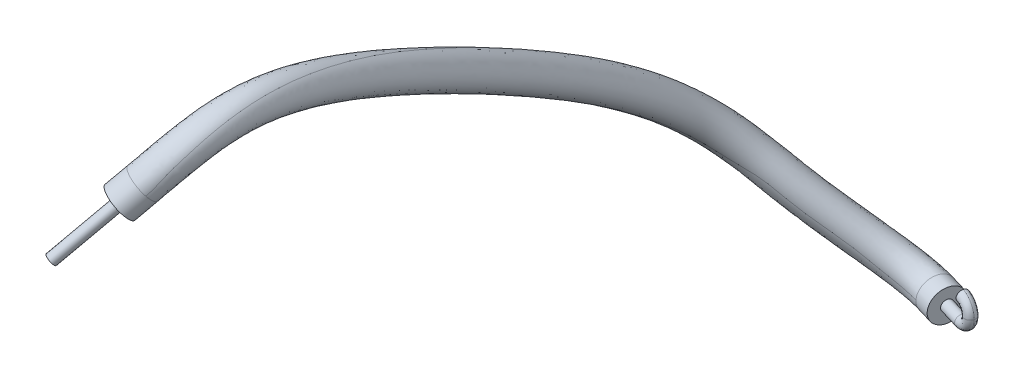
ISO-10303-21;
HEADER;
FILE_DESCRIPTION(('STEP AP214'),'2;1');
FILE_NAME('part.step','',(''),(''),'','','');
FILE_SCHEMA(('AUTOMOTIVE_DESIGN { 1 0 10303 214 1 1 1 1 }'));
ENDSEC;
DATA;
#1=APPLICATION_CONTEXT('core data for automotive mechanical design processes');
#2=APPLICATION_PROTOCOL_DEFINITION('international standard','automotive_design',2000,#1);
#3=PRODUCT_CONTEXT('',#1,'mechanical');
#4=PRODUCT('Part','Part','',(#3));
#5=PRODUCT_RELATED_PRODUCT_CATEGORY('part','',(#4));
#6=PRODUCT_DEFINITION_FORMATION('','',#4);
#7=PRODUCT_DEFINITION_CONTEXT('part definition',#1,'design');
#8=PRODUCT_DEFINITION('design','',#6,#7);
#9=PRODUCT_DEFINITION_SHAPE('','',#8);
#10=(LENGTH_UNIT() NAMED_UNIT(*) SI_UNIT(.MILLI.,.METRE.));
#11=(NAMED_UNIT(*) PLANE_ANGLE_UNIT() SI_UNIT($,.RADIAN.));
#12=(NAMED_UNIT(*) SI_UNIT($,.STERADIAN.) SOLID_ANGLE_UNIT());
#13=UNCERTAINTY_MEASURE_WITH_UNIT(LENGTH_MEASURE(1.E-05),#10,'distance_accuracy_value','');
#14=(GEOMETRIC_REPRESENTATION_CONTEXT(3) GLOBAL_UNCERTAINTY_ASSIGNED_CONTEXT((#13)) GLOBAL_UNIT_ASSIGNED_CONTEXT((#10,
#11,#12)) REPRESENTATION_CONTEXT('',''));
#15=CARTESIAN_POINT('',(0.,0.,0.));
#16=DIRECTION('',(0.,0.,1.));
#17=DIRECTION('',(1.,0.,0.));
#18=AXIS2_PLACEMENT_3D('',#15,#16,#17);
#19=CARTESIAN_POINT('',(-13.257789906,61.319217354,28.753534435));
#20=DIRECTION('',(-0.439842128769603,-0.67038088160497,0.597602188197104));
#21=DIRECTION('',(0.,-0.665425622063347,-0.746464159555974));
#22=AXIS2_PLACEMENT_3D('',#19,#20,#21);
#23=PLANE('',#22);
#24=CARTESIAN_POINT('',(-13.0305769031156,61.0677980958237,28.6387276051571));
#25=DIRECTION('',(0.439842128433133,0.67038088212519,-0.597602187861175));
#26=DIRECTION('',(0.,0.665425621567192,0.746464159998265));
#27=AXIS2_PLACEMENT_3D('',#24,#25,#26);
#28=CIRCLE('',#27,0.249999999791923);
#29=CARTESIAN_POINT('',(-13.0305769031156,61.2341545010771,28.8253436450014));
#30=VERTEX_POINT('',#29);
#31=EDGE_CURVE('E22',#30,#30,#28,.F.);
#32=ORIENTED_EDGE('',*,*,#31,.T.);
#33=EDGE_LOOP('',(#32));
#34=FACE_BOUND('',#33,.T.);
#35=ADVANCED_FACE('F17',(#34),#23,.T.);
#36=CARTESIAN_POINT('',(-13.0305769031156,61.0677980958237,28.6387276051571));
#37=DIRECTION('',(0.439842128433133,0.67038088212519,-0.597602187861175));
#38=DIRECTION('',(0.,0.665425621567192,0.746464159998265));
#39=AXIS2_PLACEMENT_3D('',#36,#37,#38);
#40=CYLINDRICAL_SURFACE('',#39,0.249999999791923);
#41=ORIENTED_EDGE('',*,*,#31,.F.);
#42=EDGE_LOOP('',(#41));
#43=FACE_BOUND('',#42,.T.);
#44=CARTESIAN_POINT('',(-11.7110505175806,63.0789407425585,26.8459210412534));
#45=DIRECTION('',(0.439842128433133,0.67038088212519,-0.597602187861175));
#46=DIRECTION('',(0.,0.665425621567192,0.746464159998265));
#47=AXIS2_PLACEMENT_3D('',#44,#45,#46);
#48=CIRCLE('',#47,0.249999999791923);
#49=CARTESIAN_POINT('',(-11.7110505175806,63.2452971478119,27.0325370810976));
#50=VERTEX_POINT('',#49);
#51=EDGE_CURVE('E81',#50,#50,#48,.F.);
#52=ORIENTED_EDGE('',*,*,#51,.T.);
#53=EDGE_LOOP('',(#52));
#54=FACE_BOUND('',#53,.T.);
#55=ADVANCED_FACE('F358',(#43,#54),#40,.T.);
#56=CARTESIAN_POINT('',(-12.632415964,63.625810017,26.781254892));
#57=DIRECTION('',(0.439842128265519,0.670380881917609,-0.597602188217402));
#58=DIRECTION('',(0.793692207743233,0.0212013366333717,0.607949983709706));
#59=AXIS2_PLACEMENT_3D('',#56,#57,#58);
#60=PLANE('',#59);
#61=ORIENTED_EDGE('',*,*,#51,.F.);
#62=EDGE_LOOP('',(#61));
#63=FACE_BOUND('',#62,.T.);
#64=CARTESIAN_POINT('',(-11.7110505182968,63.0789407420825,26.845921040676));
#65=DIRECTION('',(-0.439842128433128,-0.670380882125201,0.597602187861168));
#66=DIRECTION('',(0.,-0.665425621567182,-0.746464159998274));
#67=AXIS2_PLACEMENT_3D('',#64,#65,#66);
#68=CIRCLE('',#67,0.749999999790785);
#69=CARTESIAN_POINT('',(-11.7110505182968,62.5798715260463,26.2860729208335));
#70=VERTEX_POINT('',#69);
#71=EDGE_CURVE('E230',#70,#70,#68,.T.);
#72=ORIENTED_EDGE('',*,*,#71,.T.);
#73=EDGE_LOOP('',(#72));
#74=FACE_BOUND('',#73,.T.);
#75=ADVANCED_FACE('F349',(#63,#74),#60,.F.);
#76=CARTESIAN_POINT('',(-11.2712083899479,63.7493216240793,26.2483188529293));
#77=DIRECTION('',(-0.439842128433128,-0.670380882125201,0.597602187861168));
#78=DIRECTION('',(0.,-0.665425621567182,-0.746464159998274));
#79=AXIS2_PLACEMENT_3D('',#76,#77,#78);
#80=CYLINDRICAL_SURFACE('',#79,0.749999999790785);
#81=CARTESIAN_POINT('',(-11.2712083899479,63.7493216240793,26.2483188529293));
#82=DIRECTION('',(-0.439842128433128,-0.670380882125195,0.597602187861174));
#83=DIRECTION('',(-6.94097557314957E-11,-0.665425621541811,-0.746464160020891));
#84=AXIS2_PLACEMENT_3D('',#81,#82,#83);
#85=CIRCLE('',#84,0.749999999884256);
#86=CARTESIAN_POINT('',(-11.2712083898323,63.250252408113,25.6884707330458));
#87=VERTEX_POINT('',#86);
#88=CARTESIAN_POINT('',(-11.8664775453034,63.7334206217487,25.7923563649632));
#89=VERTEX_POINT('',#88);
#90=EDGE_CURVE('E70',#87,#89,#85,.F.);
#91=ORIENTED_EDGE('',*,*,#90,.F.);
#92=CARTESIAN_POINT('',(-11.2712083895,63.7493216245,26.248318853));
#93=DIRECTION('',(-0.439842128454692,-0.670380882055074,0.597602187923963));
#94=DIRECTION('',(0.,-0.66542562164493,-0.746464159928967));
#95=AXIS2_PLACEMENT_3D('',#92,#93,#94);
#96=CIRCLE('',#95,0.749999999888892);
#97=CARTESIAN_POINT('',(-10.6759392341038,63.7652226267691,26.7042813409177));
#98=VERTEX_POINT('',#97);
#99=EDGE_CURVE('E65',#87,#98,#96,.T.);
#100=ORIENTED_EDGE('',*,*,#99,.T.);
#101=CARTESIAN_POINT('',(-11.2712083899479,63.7493216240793,26.2483188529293));
#102=DIRECTION('',(-0.439842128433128,-0.670380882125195,0.597602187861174));
#103=DIRECTION('',(-6.94097557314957E-11,-0.665425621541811,-0.746464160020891));
#104=AXIS2_PLACEMENT_3D('',#101,#102,#103);
#105=CIRCLE('',#104,0.749999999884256);
#106=EDGE_CURVE('E75',#89,#98,#105,.F.);
#107=ORIENTED_EDGE('',*,*,#106,.F.);
#108=EDGE_LOOP('',(#91,#100,#107));
#109=FACE_BOUND('',#108,.T.);
#110=ORIENTED_EDGE('',*,*,#71,.F.);
#111=EDGE_LOOP('',(#110));
#112=FACE_BOUND('',#111,.T.);
#113=ADVANCED_FACE('F77',(#109,#112),#80,.T.);
#114=CARTESIAN_POINT('',(-1.886410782,50.644767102,-1.243295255));
#115=CARTESIAN_POINT('',(-2.052787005,50.656435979,-1.284777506));
#116=CARTESIAN_POINT('',(-2.586047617,50.727554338,-1.360258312));
#117=CARTESIAN_POINT('',(-3.188660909,50.929511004,-1.292439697));
#118=CARTESIAN_POINT('',(-3.797920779,51.197778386,-1.132885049));
#119=CARTESIAN_POINT('',(-4.368413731,51.517762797,-0.897196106));
#120=CARTESIAN_POINT('',(-5.486408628,52.148771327,-0.3162714));
#121=CARTESIAN_POINT('',(-6.24005489,52.980694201,0.268587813));
#122=CARTESIAN_POINT('',(-7.140296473,53.832477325,0.87689808));
#123=CARTESIAN_POINT('',(-7.715127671,54.334418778,1.244054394));
#124=CARTESIAN_POINT('',(-8.307239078,55.404053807,1.819371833));
#125=CARTESIAN_POINT('',(-9.003777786,56.364388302,2.67623781));
#126=CARTESIAN_POINT('',(-9.575551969,57.457507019,3.858334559));
#127=CARTESIAN_POINT('',(-9.974741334,58.500195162,5.270972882));
#128=CARTESIAN_POINT('',(-10.205702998,59.386124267,6.651079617));
#129=CARTESIAN_POINT('',(-10.41721003,60.574937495,8.633242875));
#130=CARTESIAN_POINT('',(-10.491566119,62.298252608,11.763581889));
#131=CARTESIAN_POINT('',(-10.358875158,63.677179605,14.637016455));
#132=CARTESIAN_POINT('',(-10.174687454,64.768211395,17.197628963));
#133=CARTESIAN_POINT('',(-9.934112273,65.576395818,19.490581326));
#134=CARTESIAN_POINT('',(-9.773707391,65.950283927,21.619665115));
#135=CARTESIAN_POINT('',(-9.744957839,65.930275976,23.033957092));
#136=CARTESIAN_POINT('',(-9.780948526,65.773829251,23.946886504));
#137=CARTESIAN_POINT('',(-9.885116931,65.473127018,24.776622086));
#138=CARTESIAN_POINT('',(-10.064573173,65.023037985,25.513180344));
#139=CARTESIAN_POINT('',(-10.325200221,64.480863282,26.158382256));
#140=CARTESIAN_POINT('',(-10.543997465,63.966320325,26.525015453));
#141=CARTESIAN_POINT('',(-10.675939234,63.765222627,26.704281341));
#142=CARTESIAN_POINT('',(-1.787593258,52.141305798,-1.218657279));
#143=CARTESIAN_POINT('',(-1.792222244,52.141630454,-1.219811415));
#144=CARTESIAN_POINT('',(-2.239485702,52.187859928,-1.320241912));
#145=CARTESIAN_POINT('',(-2.598512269,52.31575642,-1.286961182));
#146=CARTESIAN_POINT('',(-3.093628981,52.52086295,-1.210418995));
#147=CARTESIAN_POINT('',(-3.589289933,52.792506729,-1.059768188));
#148=CARTESIAN_POINT('',(-4.727907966,53.372271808,-0.790300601));
#149=CARTESIAN_POINT('',(-5.368343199,54.150383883,-0.062831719));
#150=CARTESIAN_POINT('',(-6.25809006,54.98437797,0.489185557));
#151=CARTESIAN_POINT('',(-6.862844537,55.488258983,0.752327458));
#152=CARTESIAN_POINT('',(-7.160328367,56.398908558,1.768675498));
#153=CARTESIAN_POINT('',(-7.802267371,57.250853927,2.561901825));
#154=CARTESIAN_POINT('',(-8.29617759,58.234965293,3.725704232));
#155=CARTESIAN_POINT('',(-8.66255523,59.205140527,5.091996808));
#156=CARTESIAN_POINT('',(-8.872877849,60.044085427,6.44615633));
#157=CARTESIAN_POINT('',(-9.047975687,61.152610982,8.420981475));
#158=CARTESIAN_POINT('',(-9.024624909,62.669749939,11.633033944));
#159=CARTESIAN_POINT('',(-8.847688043,63.732144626,14.629319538));
#160=CARTESIAN_POINT('',(-8.696370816,64.478439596,17.301561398));
#161=CARTESIAN_POINT('',(-8.575710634,64.904978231,19.694794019));
#162=CARTESIAN_POINT('',(-8.600354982,65.016692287,21.772673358));
#163=CARTESIAN_POINT('',(-8.698775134,64.850891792,23.054665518));
#164=CARTESIAN_POINT('',(-8.816999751,64.626056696,23.832979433));
#165=CARTESIAN_POINT('',(-8.988511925,64.297379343,24.500429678));
#166=CARTESIAN_POINT('',(-9.247970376,63.843802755,25.066102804));
#167=CARTESIAN_POINT('',(-9.536435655,63.35039275,25.547982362));
#168=CARTESIAN_POINT('',(-9.952805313,62.794079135,25.794081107));
#169=CARTESIAN_POINT('',(-10.045597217,62.652651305,25.920155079));
#170=CARTESIAN_POINT('',(-2.150476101,52.141305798,0.236786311));
#171=CARTESIAN_POINT('',(-2.155105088,52.141630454,0.235632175));
#172=CARTESIAN_POINT('',(-2.205011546,52.15727089,0.203404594));
#173=CARTESIAN_POINT('',(-2.370536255,52.221506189,0.192730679));
#174=CARTESIAN_POINT('',(-2.66264102,52.380890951,0.224274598));
#175=CARTESIAN_POINT('',(-3.032731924,52.631742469,0.326614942));
#176=CARTESIAN_POINT('',(-3.88735004,53.349432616,0.47371045));
#177=CARTESIAN_POINT('',(-4.65057509,53.985682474,1.239106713));
#178=CARTESIAN_POINT('',(-5.508741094,54.845562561,1.783158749));
#179=CARTESIAN_POINT('',(-6.039341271,55.423782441,2.024753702));
#180=CARTESIAN_POINT('',(-6.597682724,55.823205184,3.061477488));
#181=CARTESIAN_POINT('',(-7.150656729,56.527117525,3.705410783));
#182=CARTESIAN_POINT('',(-7.62734007,57.311903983,4.7120143));
#183=CARTESIAN_POINT('',(-7.988043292,58.171163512,5.947243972));
#184=CARTESIAN_POINT('',(-8.20944263,58.941767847,7.218607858));
#185=CARTESIAN_POINT('',(-8.438676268,59.967081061,9.114371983));
#186=CARTESIAN_POINT('',(-8.633888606,61.362028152,12.300111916));
#187=CARTESIAN_POINT('',(-8.794210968,62.358849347,15.260838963));
#188=CARTESIAN_POINT('',(-9.003569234,63.107831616,17.856699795));
#189=CARTESIAN_POINT('',(-9.275182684,63.613263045,20.125635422));
#190=CARTESIAN_POINT('',(-9.543488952,63.847219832,21.959174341));
#191=CARTESIAN_POINT('',(-9.774493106,63.799226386,22.958653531));
#192=CARTESIAN_POINT('',(-9.955124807,63.693207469,23.500282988));
#193=CARTESIAN_POINT('',(-10.157081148,63.531925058,23.922821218));
#194=CARTESIAN_POINT('',(-10.423309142,63.314398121,24.288083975));
#195=CARTESIAN_POINT('',(-10.707468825,63.018073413,24.645698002));
#196=CARTESIAN_POINT('',(-11.143343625,62.76227713,24.882156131));
#197=CARTESIAN_POINT('',(-11.236135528,62.6208493,25.008230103));
#198=CARTESIAN_POINT('',(-2.249293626,50.644767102,0.212148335));
#199=CARTESIAN_POINT('',(-2.33479623,50.650763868,0.190830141));
#200=CARTESIAN_POINT('',(-2.589106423,50.699597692,0.154030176));
#201=CARTESIAN_POINT('',(-2.950629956,50.834555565,0.189759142));
#202=CARTESIAN_POINT('',(-3.369619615,51.057994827,0.301138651));
#203=CARTESIAN_POINT('',(-3.811163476,51.356949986,0.489359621));
#204=CARTESIAN_POINT('',(-4.646653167,52.125988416,0.947539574));
#205=CARTESIAN_POINT('',(-5.5224211,52.816002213,1.570492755));
#206=CARTESIAN_POINT('',(-6.390895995,53.693658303,2.170884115));
#207=CARTESIAN_POINT('',(-6.891646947,54.269943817,2.516475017));
#208=CARTESIAN_POINT('',(-7.744587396,54.828350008,3.112175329));
#209=CARTESIAN_POINT('',(-8.35216876,55.640652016,3.819746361));
#210=CARTESIAN_POINT('',(-8.906714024,56.534445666,4.844644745));
#211=CARTESIAN_POINT('',(-9.300229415,57.466218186,6.126220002));
#212=CARTESIAN_POINT('',(-9.542267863,58.283806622,7.423531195));
#213=CARTESIAN_POINT('',(-9.807910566,59.38940758,9.326633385));
#214=CARTESIAN_POINT('',(-10.100829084,60.990531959,12.430658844));
#215=CARTESIAN_POINT('',(-10.305399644,62.303881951,15.268537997));
#216=CARTESIAN_POINT('',(-10.481884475,63.39760554,17.752765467));
#217=CARTESIAN_POINT('',(-10.633573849,64.284696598,19.921408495));
#218=CARTESIAN_POINT('',(-10.716871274,64.78076588,21.806206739));
#219=CARTESIAN_POINT('',(-10.820630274,64.878679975,22.937883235));
#220=CARTESIAN_POINT('',(-10.919248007,64.840714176,23.614427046));
#221=CARTESIAN_POINT('',(-11.053033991,64.708666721,24.198127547));
#222=CARTESIAN_POINT('',(-11.242346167,64.489923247,24.738468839));
#223=CARTESIAN_POINT('',(-11.48714864,64.162390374,25.243754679));
#224=CARTESIAN_POINT('',(-11.754110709,63.904683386,25.639686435));
#225=CARTESIAN_POINT('',(-11.866477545,63.733420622,25.792356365));
#226=(BOUNDED_SURFACE() B_SPLINE_SURFACE(3,3,((#114,#115,#116,#117,#118,#119,#120,#121,#122,
#123,#124,#125,#126,#127,#128,#129,#130,#131,#132,#133,#134,#135,#136,#137,#138,#139,#140,#141),
(#142,#143,#144,#145,#146,#147,#148,#149,#150,#151,#152,#153,#154,#155,#156,#157,#158,#159,#160,
#161,#162,#163,#164,#165,#166,#167,#168,#169),(#170,#171,#172,#173,#174,#175,#176,#177,#178,
#179,#180,#181,#182,#183,#184,#185,#186,#187,#188,#189,#190,#191,#192,#193,#194,#195,#196,#197),
(#198,#199,#200,#201,#202,#203,#204,#205,#206,#207,#208,#209,#210,#211,#212,#213,#214,#215,#216,
#217,#218,#219,#220,#221,#222,#223,#224,#225)),.UNSPECIFIED.,.F.,.F.,
.F.) B_SPLINE_SURFACE_WITH_KNOTS((4,4),(4,1,1,1,1,1,1,1,1,1,1,1,1,1,1,1,1,1,1,1,1,1,1,1,1,4),
(0.,0.5),(0.,0.0280000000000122,0.056000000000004,0.0840000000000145,0.112,0.14,
0.246124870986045,0.25,0.296875,0.343750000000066,0.390625,0.4375,0.484375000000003,
0.512894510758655,0.531250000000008,0.6015625,0.668311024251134,0.671875,0.742187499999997,
0.8125,0.84375,0.875,0.90625,0.9375,0.96875,1.),
.UNSPECIFIED.) GEOMETRIC_REPRESENTATION_ITEM() RATIONAL_B_SPLINE_SURFACE(((1.,1.,1.,1.,1.,1.,1.,
1.,1.,1.,1.,1.,1.,1.,1.,1.,1.,1.,1.,1.,1.,1.,1.,1.,1.,1.,1.,1.),(0.333333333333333,
0.333333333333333,0.333333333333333,0.333333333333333,0.333333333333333,0.333333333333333,
0.333333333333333,0.333333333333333,0.333333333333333,0.333333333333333,0.333333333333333,
0.333333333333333,0.333333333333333,0.333333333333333,0.333333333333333,0.333333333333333,
0.333333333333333,0.333333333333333,0.333333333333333,0.333333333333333,0.333333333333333,
0.333333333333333,0.333333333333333,0.333333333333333,0.333333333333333,0.333333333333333,
0.333333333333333,0.333333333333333),(0.333333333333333,0.333333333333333,0.333333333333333,
0.333333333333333,0.333333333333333,0.333333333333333,0.333333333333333,0.333333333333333,
0.333333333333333,0.333333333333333,0.333333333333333,0.333333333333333,0.333333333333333,
0.333333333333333,0.333333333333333,0.333333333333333,0.333333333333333,0.333333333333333,
0.333333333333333,0.333333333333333,0.333333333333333,0.333333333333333,0.333333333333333,
0.333333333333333,0.333333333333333,0.333333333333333,0.333333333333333,0.333333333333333),(1.,
1.,1.,1.,1.,1.,1.,1.,1.,1.,1.,1.,1.,1.,1.,1.,1.,1.,1.,1.,1.,1.,1.,1.,1.,1.,1.,1.))) REPRESENTATION_ITEM('') SURFACE());
#227=CARTESIAN_POINT('',(-2.06785220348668,50.6447671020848,-0.515573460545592));
#228=DIRECTION('',(-0.968056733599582,0.0678951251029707,-0.241363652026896));
#229=DIRECTION('',(0.250673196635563,0.241363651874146,-0.937500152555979));
#230=AXIS2_PLACEMENT_3D('',#227,#228,#229);
#231=CIRCLE('',#230,0.750000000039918);
#232=CARTESIAN_POINT('',(-2.24929362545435,50.6447671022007,0.212148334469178));
#233=VERTEX_POINT('',#232);
#234=CARTESIAN_POINT('',(-1.88641078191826,50.6447671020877,-1.24329525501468));
#235=VERTEX_POINT('',#234);
#236=EDGE_CURVE('E206',#233,#235,#231,.T.);
#237=CARTESIAN_POINT('',(-1.886410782,50.644767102,-1.243295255));
#238=CARTESIAN_POINT('',(-2.052787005,50.656435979,-1.284777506));
#239=CARTESIAN_POINT('',(-2.586047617,50.727554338,-1.360258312));
#240=CARTESIAN_POINT('',(-3.188660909,50.929511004,-1.292439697));
#241=CARTESIAN_POINT('',(-3.797920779,51.197778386,-1.132885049));
#242=CARTESIAN_POINT('',(-4.368413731,51.517762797,-0.897196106));
#243=CARTESIAN_POINT('',(-5.486408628,52.148771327,-0.3162714));
#244=CARTESIAN_POINT('',(-6.24005489,52.980694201,0.268587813));
#245=CARTESIAN_POINT('',(-7.140296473,53.832477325,0.87689808));
#246=CARTESIAN_POINT('',(-7.715127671,54.334418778,1.244054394));
#247=CARTESIAN_POINT('',(-8.307239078,55.404053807,1.819371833));
#248=CARTESIAN_POINT('',(-9.003777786,56.364388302,2.67623781));
#249=CARTESIAN_POINT('',(-9.575551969,57.457507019,3.858334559));
#250=CARTESIAN_POINT('',(-9.974741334,58.500195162,5.270972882));
#251=CARTESIAN_POINT('',(-10.205702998,59.386124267,6.651079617));
#252=CARTESIAN_POINT('',(-10.41721003,60.574937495,8.633242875));
#253=CARTESIAN_POINT('',(-10.491566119,62.298252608,11.763581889));
#254=CARTESIAN_POINT('',(-10.358875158,63.677179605,14.637016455));
#255=CARTESIAN_POINT('',(-10.174687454,64.768211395,17.197628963));
#256=CARTESIAN_POINT('',(-9.934112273,65.576395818,19.490581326));
#257=CARTESIAN_POINT('',(-9.773707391,65.950283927,21.619665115));
#258=CARTESIAN_POINT('',(-9.744957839,65.930275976,23.033957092));
#259=CARTESIAN_POINT('',(-9.780948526,65.773829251,23.946886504));
#260=CARTESIAN_POINT('',(-9.885116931,65.473127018,24.776622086));
#261=CARTESIAN_POINT('',(-10.064573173,65.023037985,25.513180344));
#262=CARTESIAN_POINT('',(-10.325200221,64.480863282,26.158382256));
#263=CARTESIAN_POINT('',(-10.543997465,63.966320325,26.525015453));
#264=CARTESIAN_POINT('',(-10.675939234,63.765222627,26.704281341));
#265=B_SPLINE_CURVE_WITH_KNOTS('',3,(#237,#238,#239,#240,#241,#242,#243,#244,#245,#246,#247,
#248,#249,#250,#251,#252,#253,#254,#255,#256,#257,#258,#259,#260,#261,#262,#263,#264),
.UNSPECIFIED.,.F.,.F.,(4,1,1,1,1,1,1,1,1,1,1,1,1,1,1,1,1,1,1,1,1,1,1,1,1,4),(0.,
0.0280000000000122,0.056000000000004,0.0840000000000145,0.112,0.14,0.246124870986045,0.25,
0.296875,0.343750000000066,0.390625,0.4375,0.484375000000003,0.512894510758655,
0.531250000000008,0.6015625,0.668311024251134,0.671875,0.742187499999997,0.8125,0.84375,0.875,
0.90625,0.9375,0.96875,1.),.UNSPECIFIED.);
#266=EDGE_CURVE('E73',#235,#98,#265,.T.);
#267=CARTESIAN_POINT('',(-2.249293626,50.644767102,0.212148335));
#268=CARTESIAN_POINT('',(-2.33479623,50.650763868,0.190830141));
#269=CARTESIAN_POINT('',(-2.589106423,50.699597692,0.154030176));
#270=CARTESIAN_POINT('',(-2.950629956,50.834555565,0.189759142));
#271=CARTESIAN_POINT('',(-3.369619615,51.057994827,0.301138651));
#272=CARTESIAN_POINT('',(-3.811163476,51.356949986,0.489359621));
#273=CARTESIAN_POINT('',(-4.646653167,52.125988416,0.947539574));
#274=CARTESIAN_POINT('',(-5.5224211,52.816002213,1.570492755));
#275=CARTESIAN_POINT('',(-6.390895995,53.693658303,2.170884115));
#276=CARTESIAN_POINT('',(-6.891646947,54.269943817,2.516475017));
#277=CARTESIAN_POINT('',(-7.744587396,54.828350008,3.112175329));
#278=CARTESIAN_POINT('',(-8.35216876,55.640652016,3.819746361));
#279=CARTESIAN_POINT('',(-8.906714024,56.534445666,4.844644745));
#280=CARTESIAN_POINT('',(-9.300229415,57.466218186,6.126220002));
#281=CARTESIAN_POINT('',(-9.542267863,58.283806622,7.423531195));
#282=CARTESIAN_POINT('',(-9.807910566,59.38940758,9.326633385));
#283=CARTESIAN_POINT('',(-10.100829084,60.990531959,12.430658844));
#284=CARTESIAN_POINT('',(-10.305399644,62.303881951,15.268537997));
#285=CARTESIAN_POINT('',(-10.481884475,63.39760554,17.752765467));
#286=CARTESIAN_POINT('',(-10.633573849,64.284696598,19.921408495));
#287=CARTESIAN_POINT('',(-10.716871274,64.78076588,21.806206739));
#288=CARTESIAN_POINT('',(-10.820630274,64.878679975,22.937883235));
#289=CARTESIAN_POINT('',(-10.919248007,64.840714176,23.614427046));
#290=CARTESIAN_POINT('',(-11.053033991,64.708666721,24.198127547));
#291=CARTESIAN_POINT('',(-11.242346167,64.489923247,24.738468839));
#292=CARTESIAN_POINT('',(-11.48714864,64.162390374,25.243754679));
#293=CARTESIAN_POINT('',(-11.754110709,63.904683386,25.639686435));
#294=CARTESIAN_POINT('',(-11.866477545,63.733420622,25.792356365));
#295=B_SPLINE_CURVE_WITH_KNOTS('',3,(#267,#268,#269,#270,#271,#272,#273,#274,#275,#276,#277,
#278,#279,#280,#281,#282,#283,#284,#285,#286,#287,#288,#289,#290,#291,#292,#293,#294),
.UNSPECIFIED.,.F.,.F.,(4,1,1,1,1,1,1,1,1,1,1,1,1,1,1,1,1,1,1,1,1,1,1,1,1,4),(0.,
0.0280000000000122,0.056000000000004,0.0840000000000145,0.112,0.14,0.246124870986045,0.25,
0.296875,0.343750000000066,0.390625,0.4375,0.484375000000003,0.512894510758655,
0.531250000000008,0.6015625,0.668311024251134,0.671875,0.742187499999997,0.8125,0.84375,0.875,
0.90625,0.9375,0.96875,1.),.UNSPECIFIED.);
#296=EDGE_CURVE('E210',#89,#233,#295,.F.);
#297=ORIENTED_EDGE('',*,*,#236,.T.);
#298=ORIENTED_EDGE('',*,*,#266,.T.);
#299=ORIENTED_EDGE('',*,*,#99,.F.);
#300=ORIENTED_EDGE('',*,*,#90,.T.);
#301=ORIENTED_EDGE('',*,*,#296,.T.);
#302=EDGE_LOOP('',(#297,#298,#299,#300,#301));
#303=FACE_BOUND('',#302,.T.);
#304=ADVANCED_FACE('F68',(#303),#226,.F.);
#305=CARTESIAN_POINT('',(-2.249293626,50.644767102,0.212148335));
#306=CARTESIAN_POINT('',(-2.33479623,50.650763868,0.190830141));
#307=CARTESIAN_POINT('',(-2.589106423,50.699597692,0.154030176));
#308=CARTESIAN_POINT('',(-2.950629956,50.834555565,0.189759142));
#309=CARTESIAN_POINT('',(-3.369619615,51.057994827,0.301138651));
#310=CARTESIAN_POINT('',(-3.811163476,51.356949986,0.489359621));
#311=CARTESIAN_POINT('',(-4.646653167,52.125988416,0.947539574));
#312=CARTESIAN_POINT('',(-5.5224211,52.816002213,1.570492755));
#313=CARTESIAN_POINT('',(-6.390895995,53.693658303,2.170884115));
#314=CARTESIAN_POINT('',(-6.891646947,54.269943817,2.516475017));
#315=CARTESIAN_POINT('',(-7.744587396,54.828350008,3.112175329));
#316=CARTESIAN_POINT('',(-8.35216876,55.640652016,3.819746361));
#317=CARTESIAN_POINT('',(-8.906714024,56.534445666,4.844644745));
#318=CARTESIAN_POINT('',(-9.300229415,57.466218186,6.126220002));
#319=CARTESIAN_POINT('',(-9.542267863,58.283806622,7.423531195));
#320=CARTESIAN_POINT('',(-9.807910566,59.38940758,9.326633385));
#321=CARTESIAN_POINT('',(-10.100829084,60.990531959,12.430658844));
#322=CARTESIAN_POINT('',(-10.305399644,62.303881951,15.268537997));
#323=CARTESIAN_POINT('',(-10.481884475,63.39760554,17.752765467));
#324=CARTESIAN_POINT('',(-10.633573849,64.284696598,19.921408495));
#325=CARTESIAN_POINT('',(-10.716871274,64.78076588,21.806206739));
#326=CARTESIAN_POINT('',(-10.820630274,64.878679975,22.937883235));
#327=CARTESIAN_POINT('',(-10.919248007,64.840714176,23.614427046));
#328=CARTESIAN_POINT('',(-11.053033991,64.708666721,24.198127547));
#329=CARTESIAN_POINT('',(-11.242346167,64.489923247,24.738468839));
#330=CARTESIAN_POINT('',(-11.48714864,64.162390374,25.243754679));
#331=CARTESIAN_POINT('',(-11.754110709,63.904683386,25.639686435));
#332=CARTESIAN_POINT('',(-11.866477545,63.733420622,25.792356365));
#333=CARTESIAN_POINT('',(-2.34811115,49.148228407,0.187510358));
#334=CARTESIAN_POINT('',(-2.514487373,49.159897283,0.146028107));
#335=CARTESIAN_POINT('',(-2.973201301,49.241924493,0.104655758));
#336=CARTESIAN_POINT('',(-3.530723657,49.44760494,0.186787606));
#337=CARTESIAN_POINT('',(-4.076598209,49.735098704,0.378002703));
#338=CARTESIAN_POINT('',(-4.589595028,50.082157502,0.6521043));
#339=CARTESIAN_POINT('',(-5.405956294,50.902544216,1.421368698));
#340=CARTESIAN_POINT('',(-6.39426711,51.646321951,1.901878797));
#341=CARTESIAN_POINT('',(-7.273050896,52.541754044,2.558609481));
#342=CARTESIAN_POINT('',(-7.743952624,53.116105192,3.008196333));
#343=CARTESIAN_POINT('',(-8.891492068,53.833494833,3.162873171));
#344=CARTESIAN_POINT('',(-9.553680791,54.754186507,3.934081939));
#345=CARTESIAN_POINT('',(-10.186087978,55.75698735,4.977275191));
#346=CARTESIAN_POINT('',(-10.612415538,56.761272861,6.305196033));
#347=CARTESIAN_POINT('',(-10.875093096,57.625845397,7.628454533));
#348=CARTESIAN_POINT('',(-11.177144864,58.811734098,9.538894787));
#349=CARTESIAN_POINT('',(-11.567769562,60.619035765,12.561205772));
#350=CARTESIAN_POINT('',(-11.81658832,62.248914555,15.276237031));
#351=CARTESIAN_POINT('',(-11.960199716,63.687379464,17.648831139));
#352=CARTESIAN_POINT('',(-11.991965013,64.956130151,19.717181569));
#353=CARTESIAN_POINT('',(-11.890253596,65.714311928,21.653239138));
#354=CARTESIAN_POINT('',(-11.866767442,65.958133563,22.917112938));
#355=CARTESIAN_POINT('',(-11.883371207,65.988220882,23.728571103));
#356=CARTESIAN_POINT('',(-11.948986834,65.885408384,24.473433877));
#357=CARTESIAN_POINT('',(-12.061383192,65.665448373,25.188853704));
#358=CARTESIAN_POINT('',(-12.266828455,65.306707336,25.841811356));
#359=CARTESIAN_POINT('',(-12.364877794,65.047089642,26.397216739));
#360=CARTESIAN_POINT('',(-12.496819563,64.845991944,26.576482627));
#361=CARTESIAN_POINT('',(-1.985228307,49.148228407,-1.267933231));
#362=CARTESIAN_POINT('',(-2.313351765,49.171241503,-1.349743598));
#363=CARTESIAN_POINT('',(-2.932609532,49.267248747,-1.400274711));
#364=CARTESIAN_POINT('',(-3.77880955,49.543265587,-1.297918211));
#365=CARTESIAN_POINT('',(-4.502212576,49.874693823,-1.055351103));
#366=CARTESIAN_POINT('',(-5.14753753,50.243018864,-0.734624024));
#367=CARTESIAN_POINT('',(-6.244909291,50.925270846,0.1577578));
#368=CARTESIAN_POINT('',(-7.111766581,51.811004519,0.600007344));
#369=CARTESIAN_POINT('',(-8.022502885,52.680576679,1.264610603));
#370=CARTESIAN_POINT('',(-8.567410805,53.180578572,1.73578133));
#371=CARTESIAN_POINT('',(-9.45414979,54.409199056,1.870068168));
#372=CARTESIAN_POINT('',(-10.205288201,55.477922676,2.790573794));
#373=CARTESIAN_POINT('',(-10.854926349,56.680048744,3.990964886));
#374=CARTESIAN_POINT('',(-11.286927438,57.795249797,5.449948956));
#375=CARTESIAN_POINT('',(-11.538528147,58.728163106,6.856002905));
#376=CARTESIAN_POINT('',(-11.786444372,59.997264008,8.84550427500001));
#377=CARTESIAN_POINT('',(-11.958507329,61.926755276,11.894129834));
#378=CARTESIAN_POINT('',(-11.870062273,63.622214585,14.644713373));
#379=CARTESIAN_POINT('',(-11.653004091,65.057983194,17.093696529));
#380=CARTESIAN_POINT('',(-11.292513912,66.247813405,19.286368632));
#381=CARTESIAN_POINT('',(-10.9470598,66.883875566,21.466656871));
#382=CARTESIAN_POINT('',(-10.791140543,67.00966016,23.013248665));
#383=CARTESIAN_POINT('',(-10.744897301,66.921601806,24.060793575));
#384=CARTESIAN_POINT('',(-10.781721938,66.648874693,25.052814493));
#385=CARTESIAN_POINT('',(-10.881175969,66.202273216,25.960257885));
#386=CARTESIAN_POINT('',(-11.113964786,65.611333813,26.768782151));
#387=CARTESIAN_POINT('',(-11.135189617,65.138561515,27.255949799));
#388=CARTESIAN_POINT('',(-11.306281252,64.877793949,27.488407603));
#389=CARTESIAN_POINT('',(-1.886410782,50.644767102,-1.243295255));
#390=CARTESIAN_POINT('',(-2.052787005,50.656435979,-1.284777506));
#391=CARTESIAN_POINT('',(-2.586047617,50.727554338,-1.360258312));
#392=CARTESIAN_POINT('',(-3.188660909,50.929511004,-1.292439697));
#393=CARTESIAN_POINT('',(-3.797920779,51.197778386,-1.132885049));
#394=CARTESIAN_POINT('',(-4.368413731,51.517762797,-0.897196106));
#395=CARTESIAN_POINT('',(-5.486408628,52.148771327,-0.3162714));
#396=CARTESIAN_POINT('',(-6.24005489,52.980694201,0.268587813));
#397=CARTESIAN_POINT('',(-7.140296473,53.832477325,0.87689808));
#398=CARTESIAN_POINT('',(-7.715127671,54.334418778,1.244054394));
#399=CARTESIAN_POINT('',(-8.307239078,55.404053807,1.819371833));
#400=CARTESIAN_POINT('',(-9.003777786,56.364388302,2.67623781));
#401=CARTESIAN_POINT('',(-9.575551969,57.457507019,3.858334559));
#402=CARTESIAN_POINT('',(-9.974741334,58.500195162,5.270972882));
#403=CARTESIAN_POINT('',(-10.205702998,59.386124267,6.651079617));
#404=CARTESIAN_POINT('',(-10.41721003,60.574937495,8.633242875));
#405=CARTESIAN_POINT('',(-10.491566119,62.298252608,11.763581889));
#406=CARTESIAN_POINT('',(-10.358875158,63.677179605,14.637016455));
#407=CARTESIAN_POINT('',(-10.174687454,64.768211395,17.197628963));
#408=CARTESIAN_POINT('',(-9.934112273,65.576395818,19.490581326));
#409=CARTESIAN_POINT('',(-9.773707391,65.950283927,21.619665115));
#410=CARTESIAN_POINT('',(-9.744957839,65.930275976,23.033957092));
#411=CARTESIAN_POINT('',(-9.780948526,65.773829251,23.946886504));
#412=CARTESIAN_POINT('',(-9.885116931,65.473127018,24.776622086));
#413=CARTESIAN_POINT('',(-10.064573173,65.023037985,25.513180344));
#414=CARTESIAN_POINT('',(-10.325200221,64.480863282,26.158382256));
#415=CARTESIAN_POINT('',(-10.543997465,63.966320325,26.525015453));
#416=CARTESIAN_POINT('',(-10.675939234,63.765222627,26.704281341));
#417=(BOUNDED_SURFACE() B_SPLINE_SURFACE(3,3,((#305,#306,#307,#308,#309,#310,#311,#312,#313,
#314,#315,#316,#317,#318,#319,#320,#321,#322,#323,#324,#325,#326,#327,#328,#329,#330,#331,#332),
(#333,#334,#335,#336,#337,#338,#339,#340,#341,#342,#343,#344,#345,#346,#347,#348,#349,#350,#351,
#352,#353,#354,#355,#356,#357,#358,#359,#360),(#361,#362,#363,#364,#365,#366,#367,#368,#369,
#370,#371,#372,#373,#374,#375,#376,#377,#378,#379,#380,#381,#382,#383,#384,#385,#386,#387,#388),
(#389,#390,#391,#392,#393,#394,#395,#396,#397,#398,#399,#400,#401,#402,#403,#404,#405,#406,#407,
#408,#409,#410,#411,#412,#413,#414,#415,#416)),.UNSPECIFIED.,.F.,.F.,
.F.) B_SPLINE_SURFACE_WITH_KNOTS((4,4),(4,1,1,1,1,1,1,1,1,1,1,1,1,1,1,1,1,1,1,1,1,1,1,1,1,4),
(0.5,1.),(0.,0.0280000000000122,0.056000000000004,0.0840000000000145,0.112,0.14,
0.246124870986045,0.25,0.296875,0.343750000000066,0.390625,0.4375,0.484375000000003,
0.512894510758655,0.531250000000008,0.6015625,0.668311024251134,0.671875,0.742187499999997,
0.8125,0.84375,0.875,0.90625,0.9375,0.96875,1.),
.UNSPECIFIED.) GEOMETRIC_REPRESENTATION_ITEM() RATIONAL_B_SPLINE_SURFACE(((1.,1.,1.,1.,1.,1.,1.,
1.,1.,1.,1.,1.,1.,1.,1.,1.,1.,1.,1.,1.,1.,1.,1.,1.,1.,1.,1.,1.),(0.333333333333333,
0.333333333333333,0.333333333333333,0.333333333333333,0.333333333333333,0.333333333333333,
0.333333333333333,0.333333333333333,0.333333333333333,0.333333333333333,0.333333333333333,
0.333333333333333,0.333333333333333,0.333333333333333,0.333333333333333,0.333333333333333,
0.333333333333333,0.333333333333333,0.333333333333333,0.333333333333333,0.333333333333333,
0.333333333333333,0.333333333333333,0.333333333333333,0.333333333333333,0.333333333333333,
0.333333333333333,0.333333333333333),(0.333333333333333,0.333333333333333,0.333333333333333,
0.333333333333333,0.333333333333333,0.333333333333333,0.333333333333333,0.333333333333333,
0.333333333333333,0.333333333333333,0.333333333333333,0.333333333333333,0.333333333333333,
0.333333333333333,0.333333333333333,0.333333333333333,0.333333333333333,0.333333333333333,
0.333333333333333,0.333333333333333,0.333333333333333,0.333333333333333,0.333333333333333,
0.333333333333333,0.333333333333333,0.333333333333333,0.333333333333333,0.333333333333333),(1.,
1.,1.,1.,1.,1.,1.,1.,1.,1.,1.,1.,1.,1.,1.,1.,1.,1.,1.,1.,1.,1.,1.,1.,1.,1.,1.,1.))) REPRESENTATION_ITEM('') SURFACE());
#418=CARTESIAN_POINT('',(-2.06785220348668,50.6447671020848,-0.515573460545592));
#419=DIRECTION('',(-0.968056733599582,0.0678951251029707,-0.241363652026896));
#420=DIRECTION('',(0.250673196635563,0.241363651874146,-0.937500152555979));
#421=AXIS2_PLACEMENT_3D('',#418,#419,#420);
#422=CIRCLE('',#421,0.750000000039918);
#423=EDGE_CURVE('E198',#235,#233,#422,.T.);
#424=ORIENTED_EDGE('',*,*,#296,.F.);
#425=ORIENTED_EDGE('',*,*,#106,.T.);
#426=ORIENTED_EDGE('',*,*,#266,.F.);
#427=ORIENTED_EDGE('',*,*,#423,.T.);
#428=EDGE_LOOP('',(#424,#425,#426,#427));
#429=FACE_BOUND('',#428,.T.);
#430=ADVANCED_FACE('F323',(#429),#417,.F.);
#431=CARTESIAN_POINT('',(-1.39021249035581,50.5972405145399,-0.346618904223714));
#432=DIRECTION('',(-0.968056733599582,0.0678951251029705,-0.241363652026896));
#433=DIRECTION('',(-0.241921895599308,0.,0.970295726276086));
#434=AXIS2_PLACEMENT_3D('',#431,#432,#433);
#435=CYLINDRICAL_SURFACE('',#434,0.749999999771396);
#436=ORIENTED_EDGE('',*,*,#423,.F.);
#437=ORIENTED_EDGE('',*,*,#236,.F.);
#438=EDGE_LOOP('',(#436,#437));
#439=FACE_BOUND('',#438,.T.);
#440=CARTESIAN_POINT('',(-1.39021249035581,50.5972405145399,-0.346618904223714));
#441=DIRECTION('',(-0.968056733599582,0.0678951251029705,-0.241363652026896));
#442=DIRECTION('',(-0.241921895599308,0.,0.970295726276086));
#443=AXIS2_PLACEMENT_3D('',#440,#441,#442);
#444=CIRCLE('',#443,0.749999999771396);
#445=CARTESIAN_POINT('',(-1.57165391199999,50.5972405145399,0.381102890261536));
#446=VERTEX_POINT('',#445);
#447=EDGE_CURVE('E205',#446,#446,#444,.F.);
#448=ORIENTED_EDGE('',*,*,#447,.F.);
#449=EDGE_LOOP('',(#448));
#450=FACE_BOUND('',#449,.T.);
#451=ADVANCED_FACE('F314',(#439,#450),#435,.T.);
#452=CARTESIAN_POINT('',(-1.195856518,51.515190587,-0.867920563));
#453=DIRECTION('',(0.96805673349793,-0.067895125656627,0.241363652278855));
#454=DIRECTION('',(-0.250673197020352,-0.24136365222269,0.937500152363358));
#455=AXIS2_PLACEMENT_3D('',#452,#453,#454);
#456=PLANE('',#455);
#457=CARTESIAN_POINT('',(-1.39021249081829,50.5972405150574,-0.346618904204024));
#458=DIRECTION('',(0.968056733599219,-0.0678951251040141,0.241363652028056));
#459=DIRECTION('',(0.241921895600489,0.,-0.970295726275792));
#460=AXIS2_PLACEMENT_3D('',#457,#458,#459);
#461=CIRCLE('',#460,0.250000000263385);
#462=CARTESIAN_POINT('',(-1.32973201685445,50.5972405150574,-0.589192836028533));
#463=VERTEX_POINT('',#462);
#464=EDGE_CURVE('E240',#463,#463,#461,.F.);
#465=ORIENTED_EDGE('',*,*,#464,.T.);
#466=EDGE_LOOP('',(#465));
#467=FACE_BOUND('',#466,.T.);
#468=ORIENTED_EDGE('',*,*,#447,.T.);
#469=EDGE_LOOP('',(#468));
#470=FACE_BOUND('',#469,.T.);
#471=ADVANCED_FACE('F306',(#467,#470),#456,.T.);
#472=CARTESIAN_POINT('',(-1.39021249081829,50.5972405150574,-0.346618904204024));
#473=DIRECTION('',(0.968056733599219,-0.0678951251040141,0.241363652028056));
#474=DIRECTION('',(0.241921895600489,0.,-0.970295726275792));
#475=AXIS2_PLACEMENT_3D('',#472,#473,#474);
#476=CYLINDRICAL_SURFACE('',#475,0.250000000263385);
#477=ORIENTED_EDGE('',*,*,#464,.F.);
#478=EDGE_LOOP('',(#477));
#479=FACE_BOUND('',#478,.T.);
#480=CARTESIAN_POINT('',(-0.541651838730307,50.5377263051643,-0.135048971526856));
#481=DIRECTION('',(0.968056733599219,-0.0678951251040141,0.241363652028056));
#482=DIRECTION('',(0.241921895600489,0.,-0.970295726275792));
#483=AXIS2_PLACEMENT_3D('',#480,#481,#482);
#484=CIRCLE('',#483,0.250000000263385);
#485=CARTESIAN_POINT('',(-0.558121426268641,50.2883031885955,-0.139155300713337));
#486=VERTEX_POINT('',#485);
#487=CARTESIAN_POINT('',(-0.525182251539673,50.7871494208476,-0.130942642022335));
#488=VERTEX_POINT('',#487);
#489=EDGE_CURVE('E243',#486,#488,#484,.T.);
#490=ORIENTED_EDGE('',*,*,#489,.F.);
#491=CARTESIAN_POINT('',(-0.541651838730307,50.5377263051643,-0.135048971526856));
#492=DIRECTION('',(0.968056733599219,-0.0678951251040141,0.241363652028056));
#493=DIRECTION('',(0.241921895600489,0.,-0.970295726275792));
#494=AXIS2_PLACEMENT_3D('',#491,#492,#493);
#495=CIRCLE('',#494,0.250000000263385);
#496=EDGE_CURVE('E249',#488,#486,#495,.T.);
#497=ORIENTED_EDGE('',*,*,#496,.F.);
#498=EDGE_LOOP('',(#490,#497));
#499=FACE_BOUND('',#498,.T.);
#500=ADVANCED_FACE('F299',(#479,#499),#476,.T.);
#501=CARTESIAN_POINT('',(-0.564077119,50.289549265,-0.114917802));
#502=CARTESIAN_POINT('',(-0.102637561,50.25718598,0.000132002));
#503=CARTESIAN_POINT('',(0.2353241,50.582596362,0.084395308));
#504=CARTESIAN_POINT('',(0.2353241,51.059262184,0.084395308));
#505=CARTESIAN_POINT('',(-0.527005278,50.273778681,-0.268041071));
#506=CARTESIAN_POINT('',(-0.056111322,50.240752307,-0.150634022));
#507=CARTESIAN_POINT('',(0.288774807,50.572829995,-0.064644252));
#508=CARTESIAN_POINT('',(0.288774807,51.059262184,-0.064644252));
#509=CARTESIAN_POINT('',(-0.491602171,50.37975731,-0.380223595));
#510=CARTESIAN_POINT('',(-0.084241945,50.351186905,-0.278657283));
#511=CARTESIAN_POINT('',(0.214111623,50.638460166,-0.204269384));
#512=CARTESIAN_POINT('',(0.214111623,51.059262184,-0.204269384));
#513=CARTESIAN_POINT('',(-0.481171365,50.537726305,-0.377622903));
#514=CARTESIAN_POINT('',(-0.168512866,50.51579785,-0.299668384));
#515=CARTESIAN_POINT('',(0.060480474,50.736286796,-0.242573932));
#516=CARTESIAN_POINT('',(0.060480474,51.059262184,-0.242573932));
#517=CARTESIAN_POINT('',(-0.470740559,50.695695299,-0.375022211));
#518=CARTESIAN_POINT('',(-0.252783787,50.680408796,-0.320679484));
#519=CARTESIAN_POINT('',(-0.093150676,50.834113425,-0.280878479));
#520=CARTESIAN_POINT('',(-0.093150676,51.059262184,-0.280878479));
#521=CARTESIAN_POINT('',(-0.492147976,50.801673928,-0.25935017));
#522=CARTESIAN_POINT('',(-0.337724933,50.790843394,-0.220848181));
#523=CARTESIAN_POINT('',(-0.224624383,50.899743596,-0.192649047));
#524=CARTESIAN_POINT('',(-0.224624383,51.059262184,-0.192649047));
#525=CARTESIAN_POINT('',(-0.531302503,50.785903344,-0.106746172));
#526=CARTESIAN_POINT('',(-0.367425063,50.774409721,-0.065886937));
#527=CARTESIAN_POINT('',(-0.247400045,50.88997723,-0.035961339));
#528=CARTESIAN_POINT('',(-0.247400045,51.059262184,-0.035961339));
#529=(BOUNDED_SURFACE() B_SPLINE_SURFACE(3,3,((#501,#502,#503,#504),(#505,#506,#507,#508),(#509,
#510,#511,#512),(#513,#514,#515,#516),(#517,#518,#519,#520),(#521,#522,#523,#524),(#525,#526,
#527,#528)),.UNSPECIFIED.,.F.,.F.,.F.) B_SPLINE_SURFACE_WITH_KNOTS((4,3,4),(4,4),(0.,0.5,1.),
(0.,1.),.UNSPECIFIED.) GEOMETRIC_REPRESENTATION_ITEM() RATIONAL_B_SPLINE_SURFACE(((1.,
0.788453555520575,0.788453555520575,1.),(0.780588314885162,0.615457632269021,0.615457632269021,
0.780588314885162),(0.780588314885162,0.615457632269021,0.615457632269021,0.780588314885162),
(1.,0.788453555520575,0.788453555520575,1.),(0.780588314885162,0.615457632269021,
0.615457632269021,0.780588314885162),(0.780588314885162,0.615457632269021,0.615457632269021,
0.780588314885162),(1.,0.788453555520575,0.788453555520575,1.))) REPRESENTATION_ITEM('') SURFACE());
#530=CARTESIAN_POINT('',(-0.24257393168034,51.059262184,-0.0604804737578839));
#531=CARTESIAN_POINT('',(-0.24257393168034,50.8907488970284,-0.0604804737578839));
#532=CARTESIAN_POINT('',(-0.362051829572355,50.7757081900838,-0.0902696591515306));
#533=CARTESIAN_POINT('',(-0.52518225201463,50.7871494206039,-0.130942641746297));
#534=(BOUNDED_CURVE() B_SPLINE_CURVE(3,(#530,#531,#532,#533),.UNSPECIFIED.,.F.,
.F.) B_SPLINE_CURVE_WITH_KNOTS((4,4),(0.,1.),
.UNSPECIFIED.) CURVE() GEOMETRIC_REPRESENTATION_ITEM() RATIONAL_B_SPLINE_CURVE((0.959415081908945,
0.756454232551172,0.756454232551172,0.959415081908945)) REPRESENTATION_ITEM(''));
#535=CARTESIAN_POINT('',(-0.242573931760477,51.059262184,-0.0604804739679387));
#536=VERTEX_POINT('',#535);
#537=EDGE_CURVE('E153',#536,#488,#534,.T.);
#538=CARTESIAN_POINT('',(0.2353241,51.059262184,0.084395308));
#539=CARTESIAN_POINT('',(0.288774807,51.059262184,-0.064644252));
#540=CARTESIAN_POINT('',(0.214111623,51.059262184,-0.204269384));
#541=CARTESIAN_POINT('',(0.060480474,51.059262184,-0.242573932));
#542=CARTESIAN_POINT('',(-0.093150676,51.059262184,-0.280878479));
#543=CARTESIAN_POINT('',(-0.224624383,51.059262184,-0.192649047));
#544=CARTESIAN_POINT('',(-0.247400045,51.059262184,-0.035961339));
#545=(BOUNDED_CURVE() B_SPLINE_CURVE(3,(#538,#539,#540,#541,#542,#543,#544),.UNSPECIFIED.,.F.,
.F.) B_SPLINE_CURVE_WITH_KNOTS((4,3,4),(0.,0.5,1.),
.UNSPECIFIED.) CURVE() GEOMETRIC_REPRESENTATION_ITEM() RATIONAL_B_SPLINE_CURVE((1.,
0.780588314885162,0.780588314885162,1.,0.780588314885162,0.780588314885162,1.)) REPRESENTATION_ITEM(''));
#546=CARTESIAN_POINT('',(0.242573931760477,51.059262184,0.0604804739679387));
#547=VERTEX_POINT('',#546);
#548=EDGE_CURVE('E250',#547,#536,#545,.T.);
#549=CARTESIAN_POINT('',(-0.558121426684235,50.2883031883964,-0.139155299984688));
#550=CARTESIAN_POINT('',(-0.0959348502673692,50.2558875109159,-0.0239192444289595));
#551=CARTESIAN_POINT('',(0.242573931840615,50.5818246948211,0.0604804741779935));
#552=CARTESIAN_POINT('',(0.242573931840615,51.059262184,0.0604804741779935));
#553=(BOUNDED_CURVE() B_SPLINE_CURVE(3,(#549,#550,#551,#552),.UNSPECIFIED.,.F.,
.F.) B_SPLINE_CURVE_WITH_KNOTS((4,4),(0.,1.),
.UNSPECIFIED.) CURVE() GEOMETRIC_REPRESENTATION_ITEM() RATIONAL_B_SPLINE_CURVE((0.959415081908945,
0.756454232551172,0.756454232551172,0.959415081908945)) REPRESENTATION_ITEM(''));
#554=EDGE_CURVE('E194',#486,#547,#553,.T.);
#555=ORIENTED_EDGE('',*,*,#537,.F.);
#556=ORIENTED_EDGE('',*,*,#548,.F.);
#557=ORIENTED_EDGE('',*,*,#554,.F.);
#558=ORIENTED_EDGE('',*,*,#489,.T.);
#559=EDGE_LOOP('',(#555,#556,#557,#558));
#560=FACE_BOUND('',#559,.T.);
#561=ADVANCED_FACE('F169',(#560),#529,.T.);
#562=CARTESIAN_POINT('',(-0.519226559,50.785903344,-0.155180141));
#563=CARTESIAN_POINT('',(-0.355349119,50.774409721,-0.114320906));
#564=CARTESIAN_POINT('',(-0.2353241,50.88997723,-0.084395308));
#565=CARTESIAN_POINT('',(-0.2353241,51.059262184,-0.084395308));
#566=CARTESIAN_POINT('',(-0.5562984,50.801673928,-0.002056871));
#567=CARTESIAN_POINT('',(-0.401875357,50.790843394,0.036445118));
#568=CARTESIAN_POINT('',(-0.288774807,50.899743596,0.064644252));
#569=CARTESIAN_POINT('',(-0.288774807,51.059262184,0.064644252));
#570=CARTESIAN_POINT('',(-0.591701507,50.695695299,0.110125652));
#571=CARTESIAN_POINT('',(-0.373744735,50.680408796,0.164468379));
#572=CARTESIAN_POINT('',(-0.214111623,50.834113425,0.204269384));
#573=CARTESIAN_POINT('',(-0.214111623,51.059262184,0.204269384));
#574=CARTESIAN_POINT('',(-0.602132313,50.537726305,0.10752496));
#575=CARTESIAN_POINT('',(-0.289473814,50.51579785,0.185479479));
#576=CARTESIAN_POINT('',(-0.060480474,50.736286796,0.242573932));
#577=CARTESIAN_POINT('',(-0.060480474,51.059262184,0.242573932));
#578=CARTESIAN_POINT('',(-0.612563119,50.37975731,0.104924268));
#579=CARTESIAN_POINT('',(-0.205202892,50.351186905,0.20649058));
#580=CARTESIAN_POINT('',(0.093150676,50.638460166,0.280878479));
#581=CARTESIAN_POINT('',(0.093150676,51.059262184,0.280878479));
#582=CARTESIAN_POINT('',(-0.591155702,50.273778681,-0.010747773));
#583=CARTESIAN_POINT('',(-0.120261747,50.240752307,0.106659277));
#584=CARTESIAN_POINT('',(0.224624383,50.572829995,0.192649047));
#585=CARTESIAN_POINT('',(0.224624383,51.059262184,0.192649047));
#586=CARTESIAN_POINT('',(-0.552001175,50.289549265,-0.16335177));
#587=CARTESIAN_POINT('',(-0.090561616,50.25718598,-0.048301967));
#588=CARTESIAN_POINT('',(0.247400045,50.582596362,0.035961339));
#589=CARTESIAN_POINT('',(0.247400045,51.059262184,0.035961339));
#590=(BOUNDED_SURFACE() B_SPLINE_SURFACE(3,3,((#562,#563,#564,#565),(#566,#567,#568,#569),(#570,
#571,#572,#573),(#574,#575,#576,#577),(#578,#579,#580,#581),(#582,#583,#584,#585),(#586,#587,
#588,#589)),.UNSPECIFIED.,.F.,.F.,.F.) B_SPLINE_SURFACE_WITH_KNOTS((4,3,4),(4,4),(0.,0.5,1.),
(0.,1.),.UNSPECIFIED.) GEOMETRIC_REPRESENTATION_ITEM() RATIONAL_B_SPLINE_SURFACE(((1.,
0.788453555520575,0.788453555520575,1.),(0.780588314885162,0.615457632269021,0.615457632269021,
0.780588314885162),(0.780588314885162,0.615457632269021,0.615457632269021,0.780588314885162),
(1.,0.788453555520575,0.788453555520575,1.),(0.780588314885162,0.61545763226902,
0.61545763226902,0.780588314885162),(0.780588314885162,0.61545763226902,0.61545763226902,
0.780588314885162),(1.,0.788453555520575,0.788453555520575,1.))) REPRESENTATION_ITEM('') SURFACE());
#591=CARTESIAN_POINT('',(-0.2353241,51.059262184,-0.084395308));
#592=CARTESIAN_POINT('',(-0.288774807,51.059262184,0.064644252));
#593=CARTESIAN_POINT('',(-0.214111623,51.059262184,0.204269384));
#594=CARTESIAN_POINT('',(-0.060480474,51.059262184,0.242573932));
#595=CARTESIAN_POINT('',(0.093150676,51.059262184,0.280878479));
#596=CARTESIAN_POINT('',(0.224624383,51.059262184,0.192649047));
#597=CARTESIAN_POINT('',(0.247400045,51.059262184,0.035961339));
#598=(BOUNDED_CURVE() B_SPLINE_CURVE(3,(#591,#592,#593,#594,#595,#596,#597),.UNSPECIFIED.,.F.,
.F.) B_SPLINE_CURVE_WITH_KNOTS((4,3,4),(0.,0.5,1.),
.UNSPECIFIED.) CURVE() GEOMETRIC_REPRESENTATION_ITEM() RATIONAL_B_SPLINE_CURVE((1.,
0.780588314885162,0.780588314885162,1.,0.780588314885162,0.780588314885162,1.)) REPRESENTATION_ITEM(''));
#599=EDGE_CURVE('E258',#536,#547,#598,.T.);
#600=ORIENTED_EDGE('',*,*,#537,.T.);
#601=ORIENTED_EDGE('',*,*,#496,.T.);
#602=ORIENTED_EDGE('',*,*,#554,.T.);
#603=ORIENTED_EDGE('',*,*,#599,.F.);
#604=EDGE_LOOP('',(#600,#601,#602,#603));
#605=FACE_BOUND('',#604,.T.);
#606=ADVANCED_FACE('F158',(#605),#590,.T.);
#607=CARTESIAN_POINT('',(-0.43884617,51.273917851,-0.299336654));
#608=DIRECTION('',(-0.964028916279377,0.113470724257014,-0.24035940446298));
#609=DIRECTION('',(-0.208100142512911,0.240359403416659,0.94811480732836));
#610=AXIS2_PLACEMENT_3D('',#607,#608,#609);
#611=PLANE('',#610);
#612=CARTESIAN_POINT('',(-0.422135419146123,51.8270134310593,-0.105250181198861));
#613=CARTESIAN_POINT('',(-0.425536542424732,51.8270252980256,-0.0916034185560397));
#614=CARTESIAN_POINT('',(-0.429070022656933,51.8258349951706,-0.0779933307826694));
#615=CARTESIAN_POINT('',(-0.436295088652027,51.8211374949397,-0.0512328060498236));
#616=CARTESIAN_POINT('',(-0.439986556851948,51.8176319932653,-0.038082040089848));
#617=CARTESIAN_POINT('',(-0.447427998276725,51.8083891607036,-0.0125994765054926));
#618=CARTESIAN_POINT('',(-0.451177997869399,51.8026507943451,-0.000268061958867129));
#619=CARTESIAN_POINT('',(-0.458627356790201,51.7891102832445,0.0232173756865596));
#620=CARTESIAN_POINT('',(-0.462326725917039,51.7813085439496,0.0343716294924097));
#621=CARTESIAN_POINT('',(-0.469568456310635,51.7638665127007,0.0551824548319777));
#622=CARTESIAN_POINT('',(-0.473110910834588,51.7542273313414,0.0648399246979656));
#623=CARTESIAN_POINT('',(-0.479945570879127,51.7333661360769,0.0824039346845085));
#624=CARTESIAN_POINT('',(-0.483237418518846,51.7221419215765,0.0903080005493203));
#625=CARTESIAN_POINT('',(-0.489467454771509,51.6984563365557,0.104113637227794));
#626=CARTESIAN_POINT('',(-0.49240612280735,51.6859966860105,0.110017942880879));
#627=CARTESIAN_POINT('',(-0.497855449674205,51.6601630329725,0.119678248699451));
#628=CARTESIAN_POINT('',(-0.500365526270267,51.6467878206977,0.123431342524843));
#629=CARTESIAN_POINT('',(-0.504879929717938,51.6195275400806,0.128668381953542));
#630=CARTESIAN_POINT('',(-0.506884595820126,51.6056428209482,0.130153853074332));
#631=CARTESIAN_POINT('',(-0.510333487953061,51.5777491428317,0.130818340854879));
#632=CARTESIAN_POINT('',(-0.511777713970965,51.5637401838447,0.129997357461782));
#633=CARTESIAN_POINT('',(-0.514065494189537,51.5359863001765,0.126070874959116));
#634=CARTESIAN_POINT('',(-0.514908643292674,51.5222415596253,0.122963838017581));
#635=CARTESIAN_POINT('',(-0.515968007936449,51.4954347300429,0.114557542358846));
#636=CARTESIAN_POINT('',(-0.516185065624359,51.482371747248,0.109261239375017));
#637=CARTESIAN_POINT('',(-0.515988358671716,51.4572614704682,0.096618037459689));
#638=CARTESIAN_POINT('',(-0.51557372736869,51.445215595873,0.089268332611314));
#639=CARTESIAN_POINT('',(-0.514124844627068,51.4225181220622,0.0727419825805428));
#640=CARTESIAN_POINT('',(-0.513091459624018,51.4118645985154,0.0635679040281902));
#641=CARTESIAN_POINT('',(-0.510433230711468,51.392220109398,0.0436324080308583));
#642=CARTESIAN_POINT('',(-0.508807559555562,51.3832314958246,0.0328687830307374));
#643=CARTESIAN_POINT('',(-0.505013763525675,51.3672023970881,0.0100855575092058));
#644=CARTESIAN_POINT('',(-0.502846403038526,51.3601591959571,-0.00193225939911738));
#645=CARTESIAN_POINT('',(-0.498026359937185,51.3481943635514,-0.0269128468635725));
#646=CARTESIAN_POINT('',(-0.495372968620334,51.3432758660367,-0.0398769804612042));
#647=CARTESIAN_POINT('',(-0.489661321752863,51.3357234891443,-0.0663505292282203));
#648=CARTESIAN_POINT('',(-0.486603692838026,51.3330861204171,-0.0798590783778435));
#649=CARTESIAN_POINT('',(-0.481378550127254,51.3307000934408,-0.101942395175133));
#650=CARTESIAN_POINT('',(-0.479307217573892,51.3302390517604,-0.110467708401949));
#651=CARTESIAN_POINT('',(-0.477185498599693,51.3302427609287,-0.118975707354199));
#652=B_SPLINE_CURVE_WITH_KNOTS('',3,(#612,#613,#614,#615,#616,#617,#618,#619,#620,#621,#622,
#623,#624,#625,#626,#627,#628,#629,#630,#631,#632,#633,#634,#635,#636,#637,#638,#639,#640,#641,
#642,#643,#644,#645,#646,#647,#648,#649,#650,#651),.UNSPECIFIED.,.F.,.F.,(4,2,2,2,2,2,2,2,2,2,2,
2,2,2,2,2,2,2,2,4),(0.,0.0421365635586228,0.0842422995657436,0.126367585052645,
0.168484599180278,0.210576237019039,0.252726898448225,0.294819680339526,0.336969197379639,
0.379090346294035,0.42121149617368,0.463361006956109,0.505453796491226,0.547604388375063,
0.589696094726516,0.631846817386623,0.67393839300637,0.716091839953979,0.758180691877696,
0.784486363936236),.UNSPECIFIED.);
#653=CARTESIAN_POINT('',(-0.422135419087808,51.8270134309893,-0.105250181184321));
#654=VERTEX_POINT('',#653);
#655=CARTESIAN_POINT('',(-0.477185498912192,51.3302427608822,-0.118975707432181));
#656=VERTEX_POINT('',#655);
#657=EDGE_CURVE('E28',#654,#656,#652,.T.);
#658=ORIENTED_EDGE('',*,*,#657,.F.);
#659=CARTESIAN_POINT('',(-0.477185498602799,51.3302427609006,-0.11897570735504));
#660=CARTESIAN_POINT('',(-0.473784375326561,51.3302308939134,-0.132622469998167));
#661=CARTESIAN_POINT('',(-0.470250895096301,51.3314211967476,-0.146232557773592));
#662=CARTESIAN_POINT('',(-0.463025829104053,51.3361186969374,-0.172993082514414));
#663=CARTESIAN_POINT('',(-0.459334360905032,51.3396241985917,-0.186143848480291));
#664=CARTESIAN_POINT('',(-0.451892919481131,51.3488670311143,-0.211626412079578));
#665=CARTESIAN_POINT('',(-0.448142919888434,51.3546053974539,-0.223957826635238));
#666=CARTESIAN_POINT('',(-0.440693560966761,51.3681459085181,-0.247443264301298));
#667=CARTESIAN_POINT('',(-0.436994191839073,51.3759476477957,-0.258597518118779));
#668=CARTESIAN_POINT('',(-0.429752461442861,51.3933896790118,-0.279408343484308));
#669=CARTESIAN_POINT('',(-0.426210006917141,51.4030288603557,-0.289065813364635));
#670=CARTESIAN_POINT('',(-0.419375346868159,51.4238900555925,-0.306629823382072));
#671=CARTESIAN_POINT('',(-0.416083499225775,51.4351142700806,-0.314533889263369));
#672=CARTESIAN_POINT('',(-0.409853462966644,51.4587998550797,-0.328339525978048));
#673=CARTESIAN_POINT('',(-0.406914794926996,51.4712595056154,-0.334243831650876));
#674=CARTESIAN_POINT('',(-0.401465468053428,51.4970931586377,-0.343904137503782));
#675=CARTESIAN_POINT('',(-0.398955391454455,51.5104683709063,-0.347657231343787));
#676=CARTESIAN_POINT('',(-0.394440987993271,51.5377286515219,-0.352894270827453));
#677=CARTESIAN_POINT('',(-0.392436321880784,51.5516133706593,-0.354379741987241));
#678=CARTESIAN_POINT('',(-0.388987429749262,51.5795070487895,-0.355044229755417));
#679=CARTESIAN_POINT('',(-0.387543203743,51.5935160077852,-0.354223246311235));
#680=CARTESIAN_POINT('',(-0.385255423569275,51.6212698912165,-0.350296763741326));
#681=CARTESIAN_POINT('',(-0.384412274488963,51.6350146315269,-0.347189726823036));
#682=CARTESIAN_POINT('',(-0.383352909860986,51.6618214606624,-0.338783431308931));
#683=CARTESIAN_POINT('',(-0.383135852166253,51.6748844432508,-0.333487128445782));
#684=CARTESIAN_POINT('',(-0.383332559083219,51.6999947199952,-0.320843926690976));
#685=CARTESIAN_POINT('',(-0.383747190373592,51.7120405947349,-0.31349422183));
#686=CARTESIAN_POINT('',(-0.385196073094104,51.734738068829,-0.296967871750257));
#687=CARTESIAN_POINT('',(-0.386229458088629,51.7453915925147,-0.287793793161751));
#688=CARTESIAN_POINT('',(-0.388887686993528,51.7650360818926,-0.267858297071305));
#689=CARTESIAN_POINT('',(-0.390513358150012,51.7740246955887,-0.257094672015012));
#690=CARTESIAN_POINT('',(-0.394307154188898,51.790053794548,-0.234311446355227));
#691=CARTESIAN_POINT('',(-0.396474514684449,51.797096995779,-0.222293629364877));
#692=CARTESIAN_POINT('',(-0.401294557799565,51.8090618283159,-0.197313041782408));
#693=CARTESIAN_POINT('',(-0.403947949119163,51.8139803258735,-0.184348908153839));
#694=CARTESIAN_POINT('',(-0.409659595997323,51.8215327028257,-0.157875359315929));
#695=CARTESIAN_POINT('',(-0.412717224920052,51.8241700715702,-0.144366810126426));
#696=CARTESIAN_POINT('',(-0.417942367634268,51.8265560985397,-0.122283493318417));
#697=CARTESIAN_POINT('',(-0.420013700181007,51.8270171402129,-0.113758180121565));
#698=CARTESIAN_POINT('',(-0.422135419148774,51.8270134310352,-0.105250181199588));
#699=B_SPLINE_CURVE_WITH_KNOTS('',3,(#659,#660,#661,#662,#663,#664,#665,#666,#667,#668,#669,
#670,#671,#672,#673,#674,#675,#676,#677,#678,#679,#680,#681,#682,#683,#684,#685,#686,#687,#688,
#689,#690,#691,#692,#693,#694,#695,#696,#697,#698),.UNSPECIFIED.,.F.,.F.,(4,2,2,2,2,2,2,2,2,2,2,
2,2,2,2,2,2,2,2,4),(0.,0.0421365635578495,0.0842422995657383,0.126367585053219,
0.168484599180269,0.210576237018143,0.252726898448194,0.294819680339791,0.336969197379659,
0.379090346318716,0.421211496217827,0.463361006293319,0.505453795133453,0.547604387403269,
0.589696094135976,0.631846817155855,0.67393839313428,0.716091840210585,0.758180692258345,
0.784486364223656),.UNSPECIFIED.);
#700=EDGE_CURVE('E35',#656,#654,#699,.T.);
#701=ORIENTED_EDGE('',*,*,#700,.F.);
#702=EDGE_LOOP('',(#658,#701));
#703=FACE_BOUND('',#702,.T.);
#704=ADVANCED_FACE('F19',(#703),#611,.T.);
#705=CARTESIAN_POINT('',(0.2353241,51.059262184,0.084395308));
#706=CARTESIAN_POINT('',(0.2353241,51.471449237,0.084395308));
#707=CARTESIAN_POINT('',(-0.030950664,51.779001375,0.018005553));
#708=CARTESIAN_POINT('',(-0.428310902,51.825772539,-0.081067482));
#709=CARTESIAN_POINT('',(0.288774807,51.059262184,-0.064644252));
#710=CARTESIAN_POINT('',(0.288774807,51.479894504,-0.064644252));
#711=CARTESIAN_POINT('',(0.017044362,51.793748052,-0.132394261));
#712=CARTESIAN_POINT('',(-0.388457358,51.841477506,-0.233497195));
#713=CARTESIAN_POINT('',(0.214111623,51.059262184,-0.204269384));
#714=CARTESIAN_POINT('',(0.214111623,51.423142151,-0.204269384));
#715=CARTESIAN_POINT('',(-0.020956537,51.694650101,-0.262878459));
#716=CARTESIAN_POINT('',(-0.371747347,51.735939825,-0.350340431));
#717=CARTESIAN_POINT('',(0.060480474,51.059262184,-0.242573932));
#718=CARTESIAN_POINT('',(0.060480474,51.338548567,-0.242573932));
#719=CARTESIAN_POINT('',(-0.119939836,51.546937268,-0.287557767));
#720=CARTESIAN_POINT('',(-0.389179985,51.578628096,-0.354686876));
#721=CARTESIAN_POINT('',(-0.093150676,51.059262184,-0.280878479));
#722=CARTESIAN_POINT('',(-0.093150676,51.253954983,-0.280878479));
#723=CARTESIAN_POINT('',(-0.218923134,51.399224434,-0.312237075));
#724=CARTESIAN_POINT('',(-0.406612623,51.421316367,-0.359033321));
#725=CARTESIAN_POINT('',(-0.224624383,51.059262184,-0.192649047));
#726=CARTESIAN_POINT('',(-0.224624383,51.197202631,-0.192649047));
#727=CARTESIAN_POINT('',(-0.313734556,51.300126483,-0.214866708));
#728=CARTESIAN_POINT('',(-0.446713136,51.315778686,-0.248021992));
#729=CARTESIAN_POINT('',(-0.247400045,51.059262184,-0.035961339));
#730=CARTESIAN_POINT('',(-0.247400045,51.205647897,-0.035961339));
#731=CARTESIAN_POINT('',(-0.3419659,51.31487316,-0.059539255));
#732=CARTESIAN_POINT('',(-0.483085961,51.331483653,-0.094724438));
#733=(BOUNDED_SURFACE() B_SPLINE_SURFACE(3,3,((#705,#706,#707,#708),(#709,#710,#711,#712),(#713,
#714,#715,#716),(#717,#718,#719,#720),(#721,#722,#723,#724),(#725,#726,#727,#728),(#729,#730,
#731,#732)),.UNSPECIFIED.,.F.,.F.,.F.) B_SPLINE_SURFACE_WITH_KNOTS((4,3,4),(4,4),(0.,0.5,1.),
(0.,1.),.UNSPECIFIED.) GEOMETRIC_REPRESENTATION_ITEM() RATIONAL_B_SPLINE_SURFACE(((1.,
0.830764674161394,0.830764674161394,1.),(0.780588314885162,0.648485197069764,0.648485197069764,
0.780588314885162),(0.780588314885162,0.648485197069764,0.648485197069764,0.780588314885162),
(1.,0.830764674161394,0.830764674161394,1.),(0.780588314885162,0.648485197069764,
0.648485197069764,0.780588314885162),(0.780588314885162,0.648485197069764,0.648485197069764,
0.780588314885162),(1.,0.830764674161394,0.830764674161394,1.))) REPRESENTATION_ITEM('') SURFACE());
#734=CARTESIAN_POINT('',(-0.477185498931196,51.3302427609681,-0.118975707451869));
#735=CARTESIAN_POINT('',(-0.336708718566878,51.3137079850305,-0.0839509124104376));
#736=CARTESIAN_POINT('',(-0.24257393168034,51.2049806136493,-0.0604804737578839));
#737=CARTESIAN_POINT('',(-0.24257393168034,51.059262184,-0.0604804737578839));
#738=(BOUNDED_CURVE() B_SPLINE_CURVE(3,(#734,#735,#736,#737),.UNSPECIFIED.,.F.,
.F.) B_SPLINE_CURVE_WITH_KNOTS((4,4),(0.,1.),
.UNSPECIFIED.) CURVE() GEOMETRIC_REPRESENTATION_ITEM() RATIONAL_B_SPLINE_CURVE((0.959415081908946,
0.797048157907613,0.797048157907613,0.959415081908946)) REPRESENTATION_ITEM(''));
#739=EDGE_CURVE('E11',#656,#536,#738,.T.);
#740=CARTESIAN_POINT('',(0.242573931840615,51.059262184,0.0604804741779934));
#741=CARTESIAN_POINT('',(0.242573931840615,51.4721165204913,0.0604804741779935));
#742=CARTESIAN_POINT('',(-0.024131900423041,51.7801665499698,-0.00601675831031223));
#743=CARTESIAN_POINT('',(-0.422135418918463,51.8270134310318,-0.105250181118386));
#744=(BOUNDED_CURVE() B_SPLINE_CURVE(3,(#740,#741,#742,#743),.UNSPECIFIED.,.F.,
.F.) B_SPLINE_CURVE_WITH_KNOTS((4,4),(0.,1.),
.UNSPECIFIED.) CURVE() GEOMETRIC_REPRESENTATION_ITEM() RATIONAL_B_SPLINE_CURVE((0.959415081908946,
0.797048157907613,0.797048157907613,0.959415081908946)) REPRESENTATION_ITEM(''));
#745=EDGE_CURVE('E90',#547,#654,#744,.T.);
#746=ORIENTED_EDGE('',*,*,#739,.F.);
#747=ORIENTED_EDGE('',*,*,#700,.T.);
#748=ORIENTED_EDGE('',*,*,#745,.F.);
#749=ORIENTED_EDGE('',*,*,#548,.T.);
#750=EDGE_LOOP('',(#746,#747,#748,#749));
#751=FACE_BOUND('',#750,.T.);
#752=ADVANCED_FACE('F105',(#751),#733,.T.);
#753=CARTESIAN_POINT('',(-0.2353241,51.059262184,-0.084395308));
#754=CARTESIAN_POINT('',(-0.2353241,51.205647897,-0.084395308));
#755=CARTESIAN_POINT('',(-0.329889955,51.31487316,-0.107973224));
#756=CARTESIAN_POINT('',(-0.471010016,51.331483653,-0.143158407));
#757=CARTESIAN_POINT('',(-0.288774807,51.059262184,0.064644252));
#758=CARTESIAN_POINT('',(-0.288774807,51.197202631,0.064644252));
#759=CARTESIAN_POINT('',(-0.377884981,51.300126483,0.04242659));
#760=CARTESIAN_POINT('',(-0.51086356,51.315778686,0.009271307));
#761=CARTESIAN_POINT('',(-0.214111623,51.059262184,0.204269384));
#762=CARTESIAN_POINT('',(-0.214111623,51.253954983,0.204269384));
#763=CARTESIAN_POINT('',(-0.339884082,51.399224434,0.172910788));
#764=CARTESIAN_POINT('',(-0.527573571,51.421316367,0.126114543));
#765=CARTESIAN_POINT('',(-0.060480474,51.059262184,0.242573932));
#766=CARTESIAN_POINT('',(-0.060480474,51.338548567,0.242573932));
#767=CARTESIAN_POINT('',(-0.240900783,51.546937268,0.197590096));
#768=CARTESIAN_POINT('',(-0.510140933,51.578628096,0.130460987));
#769=CARTESIAN_POINT('',(0.093150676,51.059262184,0.280878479));
#770=CARTESIAN_POINT('',(0.093150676,51.423142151,0.280878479));
#771=CARTESIAN_POINT('',(-0.141917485,51.694650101,0.222269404));
#772=CARTESIAN_POINT('',(-0.492708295,51.735939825,0.134807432));
#773=CARTESIAN_POINT('',(0.224624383,51.059262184,0.192649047));
#774=CARTESIAN_POINT('',(0.224624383,51.479894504,0.192649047));
#775=CARTESIAN_POINT('',(-0.047106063,51.793748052,0.124899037));
#776=CARTESIAN_POINT('',(-0.452607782,51.841477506,0.023796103));
#777=CARTESIAN_POINT('',(0.247400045,51.059262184,0.035961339));
#778=CARTESIAN_POINT('',(0.247400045,51.471449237,0.035961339));
#779=CARTESIAN_POINT('',(-0.018874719,51.779001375,-0.030428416));
#780=CARTESIAN_POINT('',(-0.416234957,51.825772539,-0.129501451));
#781=(BOUNDED_SURFACE() B_SPLINE_SURFACE(3,3,((#753,#754,#755,#756),(#757,#758,#759,#760),(#761,
#762,#763,#764),(#765,#766,#767,#768),(#769,#770,#771,#772),(#773,#774,#775,#776),(#777,#778,
#779,#780)),.UNSPECIFIED.,.F.,.F.,.F.) B_SPLINE_SURFACE_WITH_KNOTS((4,3,4),(4,4),(0.,0.5,1.),
(0.,1.),.UNSPECIFIED.) GEOMETRIC_REPRESENTATION_ITEM() RATIONAL_B_SPLINE_SURFACE(((1.,
0.830764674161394,0.830764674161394,1.),(0.780588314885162,0.648485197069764,0.648485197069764,
0.780588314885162),(0.780588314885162,0.648485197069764,0.648485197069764,0.780588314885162),
(1.,0.830764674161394,0.830764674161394,1.),(0.780588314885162,0.648485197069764,
0.648485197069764,0.780588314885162),(0.780588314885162,0.648485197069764,0.648485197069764,
0.780588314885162),(1.,0.830764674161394,0.830764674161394,1.))) REPRESENTATION_ITEM('') SURFACE());
#782=ORIENTED_EDGE('',*,*,#657,.T.);
#783=ORIENTED_EDGE('',*,*,#739,.T.);
#784=ORIENTED_EDGE('',*,*,#599,.T.);
#785=ORIENTED_EDGE('',*,*,#745,.T.);
#786=EDGE_LOOP('',(#782,#783,#784,#785));
#787=FACE_BOUND('',#786,.T.);
#788=ADVANCED_FACE('F99',(#787),#781,.T.);
#789=CLOSED_SHELL('',(#35,#55,#75,#113,#304,#430,#451,#471,#500,#561,#606,#704,#752,#788));
#790=MANIFOLD_SOLID_BREP('B1',#789);
#791=ADVANCED_BREP_SHAPE_REPRESENTATION('',(#18,#790),#14);
#792=SHAPE_DEFINITION_REPRESENTATION(#9,#791);
ENDSEC;
END-ISO-10303-21;
